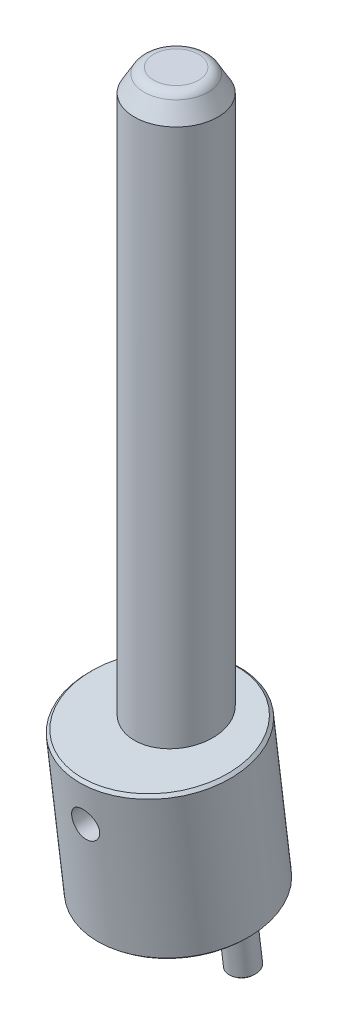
ISO-10303-21;
HEADER;
FILE_DESCRIPTION(('STEP AP214'),'2;1');
FILE_NAME('part.step','',(''),(''),'','','');
FILE_SCHEMA(('AUTOMOTIVE_DESIGN { 1 0 10303 214 1 1 1 1 }'));
ENDSEC;
DATA;
#1=APPLICATION_CONTEXT('core data for automotive mechanical design processes');
#2=APPLICATION_PROTOCOL_DEFINITION('international standard','automotive_design',2000,#1);
#3=PRODUCT_CONTEXT('',#1,'mechanical');
#4=PRODUCT('Part','Part','',(#3));
#5=PRODUCT_RELATED_PRODUCT_CATEGORY('part','',(#4));
#6=PRODUCT_DEFINITION_FORMATION('','',#4);
#7=PRODUCT_DEFINITION_CONTEXT('part definition',#1,'design');
#8=PRODUCT_DEFINITION('design','',#6,#7);
#9=PRODUCT_DEFINITION_SHAPE('','',#8);
#10=(LENGTH_UNIT() NAMED_UNIT(*) SI_UNIT(.MILLI.,.METRE.));
#11=(NAMED_UNIT(*) PLANE_ANGLE_UNIT() SI_UNIT($,.RADIAN.));
#12=(NAMED_UNIT(*) SI_UNIT($,.STERADIAN.) SOLID_ANGLE_UNIT());
#13=UNCERTAINTY_MEASURE_WITH_UNIT(LENGTH_MEASURE(1.E-05),#10,'distance_accuracy_value','');
#14=(GEOMETRIC_REPRESENTATION_CONTEXT(3) GLOBAL_UNCERTAINTY_ASSIGNED_CONTEXT((#13)) GLOBAL_UNIT_ASSIGNED_CONTEXT((#10,
#11,#12)) REPRESENTATION_CONTEXT('',''));
#15=CARTESIAN_POINT('',(0.,0.,0.));
#16=DIRECTION('',(0.,0.,1.));
#17=DIRECTION('',(1.,0.,0.));
#18=AXIS2_PLACEMENT_3D('',#15,#16,#17);
#19=CARTESIAN_POINT('',(0.,-25.2094466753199,-2.57557712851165));
#20=DIRECTION('',(0.,-0.992546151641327,-0.121869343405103));
#21=DIRECTION('',(0.,0.121869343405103,-0.992546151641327));
#22=AXIS2_PLACEMENT_3D('',#19,#20,#21);
#23=PLANE('',#22);
#24=CARTESIAN_POINT('',(-21.5,-25.2094466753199,-2.57557712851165));
#25=DIRECTION('',(0.,-0.992546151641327,-0.121869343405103));
#26=DIRECTION('',(0.,0.121869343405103,-0.992546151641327));
#27=AXIS2_PLACEMENT_3D('',#24,#25,#26);
#28=CIRCLE('',#27,4.50000075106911);
#29=CARTESIAN_POINT('',(-21.5,-24.6610345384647,-7.04203555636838));
#30=VERTEX_POINT('',#29);
#31=EDGE_CURVE('P0_E17',#30,#30,#28,.F.);
#32=ORIENTED_EDGE('',*,*,#31,.F.);
#33=EDGE_LOOP('',(#32));
#34=FACE_BOUND('',#33,.T.);
#35=ADVANCED_FACE('P0_F14',(#34),#23,.T.);
#36=CARTESIAN_POINT('',(0.,-25.2094466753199,-2.57557712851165));
#37=DIRECTION('',(0.,-0.992546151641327,-0.121869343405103));
#38=DIRECTION('',(0.,0.121869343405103,-0.992546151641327));
#39=AXIS2_PLACEMENT_3D('',#36,#37,#38);
#40=PLANE('',#39);
#41=CARTESIAN_POINT('',(21.5,-25.2094466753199,-2.57557712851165));
#42=DIRECTION('',(0.,-0.992546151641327,-0.121869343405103));
#43=DIRECTION('',(0.,0.121869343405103,-0.992546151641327));
#44=AXIS2_PLACEMENT_3D('',#41,#42,#43);
#45=CIRCLE('',#44,4.50000075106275);
#46=CARTESIAN_POINT('',(21.5,-24.6610345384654,-7.04203555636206));
#47=VERTEX_POINT('',#46);
#48=EDGE_CURVE('P0_E121',#47,#47,#45,.F.);
#49=ORIENTED_EDGE('',*,*,#48,.F.);
#50=EDGE_LOOP('',(#49));
#51=FACE_BOUND('',#50,.T.);
#52=ADVANCED_FACE('P0_F111',(#51),#40,.T.);
#53=CARTESIAN_POINT('',(0.,3.12944115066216E-12,-4.77482636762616E-13));
#54=DIRECTION('',(0.,-1.,0.));
#55=DIRECTION('',(0.,0.,-1.));
#56=AXIS2_PLACEMENT_3D('',#53,#54,#55);
#57=PLANE('',#56);
#58=CARTESIAN_POINT('',(0.,2.90045765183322E-12,-2.59850734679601E-12));
#59=DIRECTION('',(0.,-1.,0.));
#60=DIRECTION('',(0.,0.,-1.));
#61=AXIS2_PLACEMENT_3D('',#58,#59,#60);
#62=CIRCLE('',#61,15.);
#63=CARTESIAN_POINT('',(0.,2.90045765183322E-12,-15.0000000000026));
#64=VERTEX_POINT('',#63);
#65=EDGE_CURVE('P0_E36',#64,#64,#62,.F.);
#66=ORIENTED_EDGE('',*,*,#65,.T.);
#67=EDGE_LOOP('',(#66));
#68=FACE_BOUND('',#67,.T.);
#69=ADVANCED_FACE('P0_F108',(#68),#57,.F.);
#70=CARTESIAN_POINT('',(-21.5,-24.7131730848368,-2.51464239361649));
#71=DIRECTION('',(0.,0.992546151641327,0.121869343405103));
#72=DIRECTION('',(0.,-0.121869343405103,0.992546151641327));
#73=AXIS2_PLACEMENT_3D('',#70,#71,#72);
#74=CONICAL_SURFACE('',#73,5.00000135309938,0.785398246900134);
#75=CARTESIAN_POINT('',(-21.5,-24.7131717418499,-2.51464222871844));
#76=DIRECTION('',(0.,-0.992546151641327,-0.121869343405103));
#77=DIRECTION('',(0.,0.121869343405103,-0.992546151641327));
#78=AXIS2_PLACEMENT_3D('',#75,#76,#77);
#79=CIRCLE('',#78,5.);
#80=CARTESIAN_POINT('',(-21.5,-24.1038250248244,-7.47737298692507));
#81=VERTEX_POINT('',#80);
#82=EDGE_CURVE('P0_E33',#81,#81,#79,.F.);
#83=ORIENTED_EDGE('',*,*,#82,.F.);
#84=EDGE_LOOP('',(#83));
#85=FACE_BOUND('',#84,.T.);
#86=ORIENTED_EDGE('',*,*,#31,.T.);
#87=EDGE_LOOP('',(#86));
#88=FACE_BOUND('',#87,.T.);
#89=ADVANCED_FACE('P0_F104',(#85,#88),#74,.T.);
#90=CARTESIAN_POINT('',(21.5,-24.7131730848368,-2.51464239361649));
#91=DIRECTION('',(0.,0.992546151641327,0.121869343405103));
#92=DIRECTION('',(0.,-0.121869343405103,0.992546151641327));
#93=AXIS2_PLACEMENT_3D('',#90,#91,#92);
#94=CONICAL_SURFACE('',#93,5.00000135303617,0.785398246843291);
#95=CARTESIAN_POINT('',(21.5,-24.7131717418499,-2.51464222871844));
#96=DIRECTION('',(0.,-0.992546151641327,-0.121869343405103));
#97=DIRECTION('',(0.,0.121869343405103,-0.992546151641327));
#98=AXIS2_PLACEMENT_3D('',#95,#96,#97);
#99=CIRCLE('',#98,5.);
#100=CARTESIAN_POINT('',(21.5,-24.1038250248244,-7.47737298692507));
#101=VERTEX_POINT('',#100);
#102=EDGE_CURVE('P0_E29',#101,#101,#99,.F.);
#103=ORIENTED_EDGE('',*,*,#102,.F.);
#104=EDGE_LOOP('',(#103));
#105=FACE_BOUND('',#104,.T.);
#106=ORIENTED_EDGE('',*,*,#48,.T.);
#107=EDGE_LOOP('',(#106));
#108=FACE_BOUND('',#107,.T.);
#109=ADVANCED_FACE('P0_F99',(#105,#108),#94,.T.);
#110=CARTESIAN_POINT('',(0.,59.7458556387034,-2.59872418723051E-12));
#111=DIRECTION('',(0.,-1.,0.));
#112=DIRECTION('',(0.,0.,-1.));
#113=AXIS2_PLACEMENT_3D('',#110,#111,#112);
#114=CYLINDRICAL_SURFACE('',#113,15.);
#115=CARTESIAN_POINT('',(0.,45.0000000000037,-2.59959154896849E-12));
#116=DIRECTION('',(0.,0.992546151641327,0.121869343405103));
#117=DIRECTION('',(0.,-0.121869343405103,0.992546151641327));
#118=AXIS2_PLACEMENT_3D('',#115,#116,#117);
#119=ELLIPSE('',#118,15.1126473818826,15.);
#120=CARTESIAN_POINT('',(0.,43.1582315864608,14.9999999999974));
#121=VERTEX_POINT('',#120);
#122=EDGE_CURVE('P0_E32',#121,#121,#119,.F.);
#123=ORIENTED_EDGE('',*,*,#122,.F.);
#124=EDGE_LOOP('',(#123));
#125=FACE_BOUND('',#124,.T.);
#126=ORIENTED_EDGE('',*,*,#65,.F.);
#127=EDGE_LOOP('',(#126));
#128=FACE_BOUND('',#127,.T.);
#129=CARTESIAN_POINT('',(0.,31.0000000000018,14.9999999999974));
#130=CARTESIAN_POINT('',(-0.13627460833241,30.9999999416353,14.9999999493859));
#131=CARTESIAN_POINT('',(-0.27255067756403,30.9944241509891,14.9981386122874));
#132=CARTESIAN_POINT('',(-0.544142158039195,30.9721706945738,14.9907428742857));
#133=CARTESIAN_POINT('',(-0.679457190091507,30.9554888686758,14.9852070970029));
#134=CARTESIAN_POINT('',(-0.948257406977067,30.9111491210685,14.9706027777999));
#135=CARTESIAN_POINT('',(-1.08174007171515,30.8834773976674,14.9615297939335));
#136=CARTESIAN_POINT('',(-1.34580155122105,30.8174009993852,14.9400929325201));
#137=CARTESIAN_POINT('',(-1.47637921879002,30.7789921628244,14.9277277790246));
#138=CARTESIAN_POINT('',(-1.7333461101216,30.6918928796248,14.9000723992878));
#139=CARTESIAN_POINT('',(-1.85974572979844,30.6432305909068,14.8847901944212));
#140=CARTESIAN_POINT('',(-2.10792399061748,30.5359631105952,14.8516789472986));
#141=CARTESIAN_POINT('',(-2.22970089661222,30.4773542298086,14.8338489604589));
#142=CARTESIAN_POINT('',(-2.58680471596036,30.2873070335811,14.7772227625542));
#143=CARTESIAN_POINT('',(-2.81420620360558,30.1415453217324,14.735256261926));
#144=CARTESIAN_POINT('',(-3.24874257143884,29.8108587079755,14.6457020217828));
#145=CARTESIAN_POINT('',(-3.45501840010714,29.6248491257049,14.5979792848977));
#146=CARTESIAN_POINT('',(-3.8341436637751,29.2211801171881,14.5030192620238));
#147=CARTESIAN_POINT('',(-4.0069839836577,29.0035120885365,14.4557821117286));
#148=CARTESIAN_POINT('',(-4.31912807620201,28.5350726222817,14.3656662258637));
#149=CARTESIAN_POINT('',(-4.45732572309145,28.2835298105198,14.322951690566));
#150=CARTESIAN_POINT('',(-4.68909399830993,27.7591186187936,14.2487652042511));
#151=CARTESIAN_POINT('',(-4.78267844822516,27.4862568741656,14.2172897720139));
#152=CARTESIAN_POINT('',(-4.91936749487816,26.9366338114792,14.1705651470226));
#153=CARTESIAN_POINT('',(-4.96406724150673,26.6603139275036,14.1548047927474));
#154=CARTESIAN_POINT('',(-5.00670561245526,26.1036813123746,14.1397828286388));
#155=CARTESIAN_POINT('',(-5.00465868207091,25.8233698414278,14.1405161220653));
#156=CARTESIAN_POINT('',(-4.95509941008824,25.280317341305,14.1579507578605));
#157=CARTESIAN_POINT('',(-4.90966912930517,25.0173587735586,14.1739208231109));
#158=CARTESIAN_POINT('',(-4.77803186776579,24.5030345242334,14.2188326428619));
#159=CARTESIAN_POINT('',(-4.69181981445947,24.2516702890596,14.2477760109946));
#160=CARTESIAN_POINT('',(-4.47968995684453,23.7629279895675,14.3158968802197));
#161=CARTESIAN_POINT('',(-4.3531541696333,23.5258408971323,14.355231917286));
#162=CARTESIAN_POINT('',(-4.06444611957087,23.0756402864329,14.4396288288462));
#163=CARTESIAN_POINT('',(-3.90226546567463,22.8625324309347,14.484692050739));
#164=CARTESIAN_POINT('',(-3.53674216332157,22.4545530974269,14.5783642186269));
#165=CARTESIAN_POINT('',(-3.33169626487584,22.2612084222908,14.6270356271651));
#166=CARTESIAN_POINT('',(-3.00176707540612,21.9988448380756,14.6970107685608));
#167=CARTESIAN_POINT('',(-2.88796886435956,21.9159467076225,14.7198467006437));
#168=CARTESIAN_POINT('',(-2.65358317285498,21.7599196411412,14.763897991));
#169=CARTESIAN_POINT('',(-2.53299841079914,21.6867868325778,14.7851139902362));
#170=CARTESIAN_POINT('',(-2.28442944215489,21.5500863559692,14.8255663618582));
#171=CARTESIAN_POINT('',(-2.15637801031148,21.4866337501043,14.8447781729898));
#172=CARTESIAN_POINT('',(-1.89503347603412,21.3708247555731,14.880397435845));
#173=CARTESIAN_POINT('',(-1.76174256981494,21.3184637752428,14.8968060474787));
#174=CARTESIAN_POINT('',(-1.49104566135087,21.2253547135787,14.9263287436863));
#175=CARTESIAN_POINT('',(-1.3536464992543,21.1845884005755,14.9394479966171));
#176=CARTESIAN_POINT('',(-1.0756272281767,21.1149668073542,14.9620340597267));
#177=CARTESIAN_POINT('',(-0.93500858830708,21.0861062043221,14.9715025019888));
#178=CARTESIAN_POINT('',(-0.662330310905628,21.0422867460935,14.9859443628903));
#179=CARTESIAN_POINT('',(-0.530427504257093,21.0264417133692,14.9912035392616));
#180=CARTESIAN_POINT('',(-0.265683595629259,21.0052983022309,14.9982313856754));
#181=CARTESIAN_POINT('',(-0.132842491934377,20.9999999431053,15.0000000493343));
#182=CARTESIAN_POINT('',(0.136274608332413,21.0000000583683,14.9999999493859));
#183=CARTESIAN_POINT('',(0.272550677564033,21.0055758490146,14.9981386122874));
#184=CARTESIAN_POINT('',(0.544142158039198,21.0278293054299,14.9907428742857));
#185=CARTESIAN_POINT('',(0.67945719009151,21.0445111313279,14.9852070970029));
#186=CARTESIAN_POINT('',(0.94825740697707,21.0888508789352,14.9706027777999));
#187=CARTESIAN_POINT('',(1.08174007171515,21.1165226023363,14.9615297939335));
#188=CARTESIAN_POINT('',(1.34580155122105,21.1825990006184,14.9400929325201));
#189=CARTESIAN_POINT('',(1.47637921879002,21.2210078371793,14.9277277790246));
#190=CARTESIAN_POINT('',(1.7333461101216,21.3081071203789,14.9000723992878));
#191=CARTESIAN_POINT('',(1.85974572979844,21.3567694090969,14.8847901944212));
#192=CARTESIAN_POINT('',(2.10792399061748,21.4640368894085,14.8516789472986));
#193=CARTESIAN_POINT('',(2.22970089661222,21.5226457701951,14.8338489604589));
#194=CARTESIAN_POINT('',(2.58680471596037,21.7126929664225,14.7772227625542));
#195=CARTESIAN_POINT('',(2.81420620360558,21.8584546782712,14.735256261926));
#196=CARTESIAN_POINT('',(3.24874257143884,22.1891412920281,14.6457020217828));
#197=CARTESIAN_POINT('',(3.45501840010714,22.3751508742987,14.5979792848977));
#198=CARTESIAN_POINT('',(3.8341436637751,22.7788198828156,14.5030192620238));
#199=CARTESIAN_POINT('',(4.0069839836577,22.9964879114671,14.4557821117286));
#200=CARTESIAN_POINT('',(4.31912807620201,23.464927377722,14.3656662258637));
#201=CARTESIAN_POINT('',(4.45732572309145,23.7164701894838,14.322951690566));
#202=CARTESIAN_POINT('',(4.68909399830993,24.24088138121,14.2487652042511));
#203=CARTESIAN_POINT('',(4.78267844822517,24.5137431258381,14.2172897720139));
#204=CARTESIAN_POINT('',(4.91936749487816,25.0633661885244,14.1705651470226));
#205=CARTESIAN_POINT('',(4.96406724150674,25.3396860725,14.1548047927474));
#206=CARTESIAN_POINT('',(5.00670561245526,25.896318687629,14.1397828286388));
#207=CARTESIAN_POINT('',(5.00465868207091,26.1766301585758,14.1405161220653));
#208=CARTESIAN_POINT('',(4.95509941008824,26.7196826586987,14.1579507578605));
#209=CARTESIAN_POINT('',(4.90966912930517,26.982641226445,14.1739208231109));
#210=CARTESIAN_POINT('',(4.77803186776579,27.4969654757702,14.2188326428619));
#211=CARTESIAN_POINT('',(4.69181981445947,27.748329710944,14.2477760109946));
#212=CARTESIAN_POINT('',(4.47968995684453,28.2370720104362,14.3158968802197));
#213=CARTESIAN_POINT('',(4.35315416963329,28.4741591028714,14.355231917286));
#214=CARTESIAN_POINT('',(4.06444611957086,28.9243597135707,14.4396288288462));
#215=CARTESIAN_POINT('',(3.90226546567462,29.1374675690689,14.484692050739));
#216=CARTESIAN_POINT('',(3.53674216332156,29.5454469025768,14.5783642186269));
#217=CARTESIAN_POINT('',(3.33169626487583,29.7387915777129,14.6270356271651));
#218=CARTESIAN_POINT('',(3.00176707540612,30.0011551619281,14.6970107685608));
#219=CARTESIAN_POINT('',(2.88796886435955,30.0840532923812,14.7198467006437));
#220=CARTESIAN_POINT('',(2.65358317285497,30.2400803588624,14.763897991));
#221=CARTESIAN_POINT('',(2.53299841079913,30.3132131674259,14.7851139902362));
#222=CARTESIAN_POINT('',(2.28442944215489,30.4499136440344,14.8255663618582));
#223=CARTESIAN_POINT('',(2.15637801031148,30.5133662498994,14.8447781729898));
#224=CARTESIAN_POINT('',(1.89503347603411,30.6291752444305,14.880397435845));
#225=CARTESIAN_POINT('',(1.76174256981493,30.6815362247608,14.8968060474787));
#226=CARTESIAN_POINT('',(1.49104566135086,30.7746452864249,14.9263287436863));
#227=CARTESIAN_POINT('',(1.3536464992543,30.8154115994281,14.9394479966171));
#228=CARTESIAN_POINT('',(1.0756272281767,30.8850331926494,14.9620340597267));
#229=CARTESIAN_POINT('',(0.935008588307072,30.9138937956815,14.9715025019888));
#230=CARTESIAN_POINT('',(0.662330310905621,30.9577132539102,14.9859443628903));
#231=CARTESIAN_POINT('',(0.530427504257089,30.9735582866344,14.9912035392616));
#232=CARTESIAN_POINT('',(0.265683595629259,30.9947016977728,14.9982313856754));
#233=CARTESIAN_POINT('',(0.132842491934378,31.0000000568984,15.0000000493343));
#234=CARTESIAN_POINT('',(0.,31.0000000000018,14.9999999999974));
#235=B_SPLINE_CURVE_WITH_KNOTS('',3,(#129,#130,#131,#132,#133,#134,#135,#136,#137,#138,#139,
#140,#141,#142,#143,#144,#145,#146,#147,#148,#149,#150,#151,#152,#153,#154,#155,#156,#157,#158,
#159,#160,#161,#162,#163,#164,#165,#166,#167,#168,#169,#170,#171,#172,#173,#174,#175,#176,#177,
#178,#179,#180,#181,#182,#183,#184,#185,#186,#187,#188,#189,#190,#191,#192,#193,#194,#195,#196,
#197,#198,#199,#200,#201,#202,#203,#204,#205,#206,#207,#208,#209,#210,#211,#212,#213,#214,#215,
#216,#217,#218,#219,#220,#221,#222,#223,#224,#225,#226,#227,#228,#229,#230,#231,#232,#233,#234),
.UNSPECIFIED.,.T.,.F.,(4,2,2,2,2,2,2,2,2,2,2,2,2,2,2,2,2,2,2,2,2,2,2,2,2,2,2,2,2,2,2,2,2,2,2,2,
2,2,2,2,2,2,2,2,2,2,2,2,2,2,2,2,4),(0.,0.408700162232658,0.817553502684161,1.22692193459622,
1.6364492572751,2.04486626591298,2.45343508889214,3.26962321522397,4.11140352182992,
4.9534129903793,5.81961254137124,6.68554356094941,7.52228757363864,8.35877302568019,
9.15703078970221,9.95538786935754,10.7666215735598,11.5780464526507,12.4317109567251,
12.8591940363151,13.286507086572,13.7185586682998,14.150431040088,14.5816205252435,
15.0126170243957,15.4110232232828,15.8094301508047,16.2181303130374,16.6269836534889,
17.0363520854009,17.4458794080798,17.8542964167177,18.2628652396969,19.0790533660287,
19.9208336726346,20.762843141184,21.629042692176,22.4949737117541,23.3317177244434,
24.1682031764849,24.9664609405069,25.7648180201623,26.5760517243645,27.3874766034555,
28.2411411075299,28.6686241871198,29.0959372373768,29.5279888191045,29.9598611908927,
30.3910506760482,30.8220471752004,31.2204533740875,31.6188603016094),.UNSPECIFIED.);
#236=CARTESIAN_POINT('',(0.,31.0000000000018,14.9999999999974));
#237=VERTEX_POINT('',#236);
#238=EDGE_CURVE('P0_E84',#237,#237,#235,.T.);
#239=ORIENTED_EDGE('',*,*,#238,.T.);
#240=EDGE_LOOP('',(#239));
#241=FACE_BOUND('',#240,.T.);
#242=ADVANCED_FACE('P0_F93',(#125,#128,#241),#114,.F.);
#243=CARTESIAN_POINT('',(-21.5,-10.3212544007,-0.7475369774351));
#244=DIRECTION('',(0.,-0.992546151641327,-0.121869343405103));
#245=DIRECTION('',(0.,0.121869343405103,-0.992546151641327));
#246=AXIS2_PLACEMENT_3D('',#243,#244,#245);
#247=CYLINDRICAL_SURFACE('',#246,5.);
#248=CARTESIAN_POINT('',(-21.5,-10.3212544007,-0.7475369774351));
#249=DIRECTION('',(0.,-0.992546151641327,-0.121869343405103));
#250=DIRECTION('',(0.,0.121869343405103,-0.992546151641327));
#251=AXIS2_PLACEMENT_3D('',#248,#249,#250);
#252=CIRCLE('',#251,5.);
#253=CARTESIAN_POINT('',(-21.5,-9.71190768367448,-5.71026773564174));
#254=VERTEX_POINT('',#253);
#255=EDGE_CURVE('P0_E80',#254,#254,#252,.T.);
#256=ORIENTED_EDGE('',*,*,#255,.T.);
#257=EDGE_LOOP('',(#256));
#258=FACE_BOUND('',#257,.T.);
#259=ORIENTED_EDGE('',*,*,#82,.T.);
#260=EDGE_LOOP('',(#259));
#261=FACE_BOUND('',#260,.T.);
#262=ADVANCED_FACE('P0_F98',(#258,#261),#247,.T.);
#263=CARTESIAN_POINT('',(21.5,-10.3212544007,-0.7475369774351));
#264=DIRECTION('',(0.,-0.992546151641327,-0.121869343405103));
#265=DIRECTION('',(0.,0.121869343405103,-0.992546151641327));
#266=AXIS2_PLACEMENT_3D('',#263,#264,#265);
#267=CYLINDRICAL_SURFACE('',#266,5.);
#268=CARTESIAN_POINT('',(21.5,-10.3212544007,-0.7475369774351));
#269=DIRECTION('',(0.,-0.992546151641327,-0.121869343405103));
#270=DIRECTION('',(0.,0.121869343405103,-0.992546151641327));
#271=AXIS2_PLACEMENT_3D('',#268,#269,#270);
#272=CIRCLE('',#271,5.);
#273=CARTESIAN_POINT('',(21.5,-9.71190768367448,-5.71026773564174));
#274=VERTEX_POINT('',#273);
#275=EDGE_CURVE('P0_E76',#274,#274,#272,.T.);
#276=ORIENTED_EDGE('',*,*,#275,.T.);
#277=EDGE_LOOP('',(#276));
#278=FACE_BOUND('',#277,.T.);
#279=ORIENTED_EDGE('',*,*,#102,.T.);
#280=EDGE_LOOP('',(#279));
#281=FACE_BOUND('',#280,.T.);
#282=ADVANCED_FACE('P0_F178',(#278,#281),#267,.T.);
#283=CARTESIAN_POINT('',(0.,44.268783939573,5.95527690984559));
#284=DIRECTION('',(0.,0.992546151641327,0.121869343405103));
#285=DIRECTION('',(0.,-0.121869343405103,0.992546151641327));
#286=AXIS2_PLACEMENT_3D('',#283,#284,#285);
#287=PLANE('',#286);
#288=ORIENTED_EDGE('',*,*,#122,.T.);
#289=EDGE_LOOP('',(#288));
#290=FACE_BOUND('',#289,.T.);
#291=CARTESIAN_POINT('',(0.,44.268783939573,5.95527690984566));
#292=DIRECTION('',(0.,0.992546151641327,0.121869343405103));
#293=DIRECTION('',(0.,-0.121869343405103,0.992546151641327));
#294=AXIS2_PLACEMENT_3D('',#291,#292,#293);
#295=CIRCLE('',#294,27.9999945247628);
#296=CARTESIAN_POINT('',(0.,40.8564429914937,33.7465637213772));
#297=VERTEX_POINT('',#296);
#298=EDGE_CURVE('P0_E46',#297,#297,#295,.F.);
#299=ORIENTED_EDGE('',*,*,#298,.F.);
#300=EDGE_LOOP('',(#299));
#301=FACE_BOUND('',#300,.T.);
#302=ADVANCED_FACE('P0_F71',(#290,#301),#287,.T.);
#303=CARTESIAN_POINT('',(0.,26.0000000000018,-4.49837953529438));
#304=DIRECTION('',(0.,0.,1.));
#305=DIRECTION('',(0.,-1.,0.));
#306=AXIS2_PLACEMENT_3D('',#303,#304,#305);
#307=CYLINDRICAL_SURFACE('',#306,5.);
#308=ORIENTED_EDGE('',*,*,#238,.F.);
#309=EDGE_LOOP('',(#308));
#310=FACE_BOUND('',#309,.T.);
#311=CARTESIAN_POINT('',(0.,21.0000000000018,32.3160144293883));
#312=CARTESIAN_POINT('',(-0.1403461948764,21.0000006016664,32.3160142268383));
#313=CARTESIAN_POINT('',(-0.280708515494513,21.0059135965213,32.315711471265));
#314=CARTESIAN_POINT('',(-0.560489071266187,21.0295298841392,32.3145230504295));
#315=CARTESIAN_POINT('',(-0.699906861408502,21.0472383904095,32.3136371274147));
#316=CARTESIAN_POINT('',(-0.976970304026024,21.094359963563,32.3113500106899));
#317=CARTESIAN_POINT('',(-1.11461288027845,21.1237911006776,32.3099480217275));
#318=CARTESIAN_POINT('',(-1.38697401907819,21.1941604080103,32.3067422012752));
#319=CARTESIAN_POINT('',(-1.52169146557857,21.2351028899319,32.3049382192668));
#320=CARTESIAN_POINT('',(-1.78703419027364,21.3281426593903,32.3010858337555));
#321=CARTESIAN_POINT('',(-1.91766413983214,21.3802266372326,32.2990377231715));
#322=CARTESIAN_POINT('',(-2.17412119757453,21.4952299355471,32.2948846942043));
#323=CARTESIAN_POINT('',(-2.29994651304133,21.5581532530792,32.2927797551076));
#324=CARTESIAN_POINT('',(-2.54575621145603,21.6943233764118,32.2887356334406));
#325=CARTESIAN_POINT('',(-2.66574505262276,21.7675621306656,32.2867963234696));
#326=CARTESIAN_POINT('',(-2.89917970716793,21.9239113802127,32.2833237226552));
#327=CARTESIAN_POINT('',(-3.01262309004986,22.0070255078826,32.2817905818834));
#328=CARTESIAN_POINT('',(-3.232146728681,22.1825423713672,32.2793890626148));
#329=CARTESIAN_POINT('',(-3.33822469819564,22.2749479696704,32.2785208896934));
#330=CARTESIAN_POINT('',(-3.5422598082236,22.4684045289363,32.2777149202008));
#331=CARTESIAN_POINT('',(-3.64021392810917,22.5694586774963,32.2777774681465));
#332=CARTESIAN_POINT('',(-3.82722424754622,22.7794235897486,32.2790961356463));
#333=CARTESIAN_POINT('',(-3.91628336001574,22.8883317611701,32.2803518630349));
#334=CARTESIAN_POINT('',(-4.08493121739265,23.1132880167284,32.2843069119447));
#335=CARTESIAN_POINT('',(-4.16451648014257,23.2293387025,32.2870067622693));
#336=CARTESIAN_POINT('',(-4.31322552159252,23.4670878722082,32.294060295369));
#337=CARTESIAN_POINT('',(-4.38240064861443,23.5887544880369,32.2984054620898));
#338=CARTESIAN_POINT('',(-4.51030821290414,23.8374364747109,32.3089450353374));
#339=CARTESIAN_POINT('',(-4.56903679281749,23.9644537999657,32.3151401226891));
#340=CARTESIAN_POINT('',(-4.67558894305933,24.2228181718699,32.3295311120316));
#341=CARTESIAN_POINT('',(-4.72341729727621,24.354163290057,32.3377261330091));
#342=CARTESIAN_POINT('',(-4.80789683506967,24.6202704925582,32.3562192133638));
#343=CARTESIAN_POINT('',(-4.84454391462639,24.7550338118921,32.3665180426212));
#344=CARTESIAN_POINT('',(-4.93688227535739,25.1611177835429,32.4005185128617));
#345=CARTESIAN_POINT('',(-4.9757781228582,25.4362013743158,32.4274299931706));
#346=CARTESIAN_POINT('',(-5.00762672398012,25.9879273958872,32.4895650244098));
#347=CARTESIAN_POINT('',(-5.00057783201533,26.2645698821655,32.5247888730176));
#348=CARTESIAN_POINT('',(-4.94109053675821,26.81396350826,32.6026732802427));
#349=CARTESIAN_POINT('',(-4.88831502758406,27.086670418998,32.6453871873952));
#350=CARTESIAN_POINT('',(-4.7387120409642,27.6189440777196,32.7361104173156));
#351=CARTESIAN_POINT('',(-4.64187793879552,27.8785088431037,32.7841205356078));
#352=CARTESIAN_POINT('',(-4.46456377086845,28.2555797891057,32.8586334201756));
#353=CARTESIAN_POINT('',(-4.39916939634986,28.3805882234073,32.8841965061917));
#354=CARTESIAN_POINT('',(-4.25809696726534,28.6245830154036,32.935611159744));
#355=CARTESIAN_POINT('',(-4.18242246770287,28.7435714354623,32.9614626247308));
#356=CARTESIAN_POINT('',(-4.02125558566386,28.9747907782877,33.0130529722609));
#357=CARTESIAN_POINT('',(-3.93575922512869,29.0870189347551,33.0387918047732));
#358=CARTESIAN_POINT('',(-3.75555564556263,29.3038867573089,33.0897102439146));
#359=CARTESIAN_POINT('',(-3.66085184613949,29.4085292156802,33.114890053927));
#360=CARTESIAN_POINT('',(-3.46147534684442,29.6109051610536,33.1645984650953));
#361=CARTESIAN_POINT('',(-3.35668562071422,29.708526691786,33.1891137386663));
#362=CARTESIAN_POINT('',(-3.13896542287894,29.8945330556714,33.2366741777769));
#363=CARTESIAN_POINT('',(-3.02603811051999,29.98292144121,33.2597199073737));
#364=CARTESIAN_POINT('',(-2.79266578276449,30.149893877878,33.303929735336));
#365=CARTESIAN_POINT('',(-2.67221491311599,30.2284701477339,33.3250923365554));
#366=CARTESIAN_POINT('',(-2.42475245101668,30.3750711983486,33.3650874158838));
#367=CARTESIAN_POINT('',(-2.29774365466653,30.4431004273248,33.3839208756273));
#368=CARTESIAN_POINT('',(-2.04039417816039,30.5669254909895,33.4185615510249));
#369=CARTESIAN_POINT('',(-1.91015664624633,30.6229219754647,33.4344177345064));
#370=CARTESIAN_POINT('',(-1.6451638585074,30.7237189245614,33.4631901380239));
#371=CARTESIAN_POINT('',(-1.51041056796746,30.7685241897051,33.4761076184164));
#372=CARTESIAN_POINT('',(-1.23759367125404,30.8464886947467,33.4987168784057));
#373=CARTESIAN_POINT('',(-1.09953687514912,30.8796700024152,33.5084147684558));
#374=CARTESIAN_POINT('',(-0.820969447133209,30.9341801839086,33.5244053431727));
#375=CARTESIAN_POINT('',(-0.680460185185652,30.9555154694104,33.5306998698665));
#376=CARTESIAN_POINT('',(-0.449764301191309,30.9805445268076,33.5380965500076));
#377=CARTESIAN_POINT('',(-0.359985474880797,30.9878372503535,33.5402559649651));
#378=CARTESIAN_POINT('',(-0.180141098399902,30.9975652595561,33.5431378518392));
#379=CARTESIAN_POINT('',(-0.0900755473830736,31.0000005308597,33.5438603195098));
#380=CARTESIAN_POINT('',(0.13670924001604,30.9999991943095,33.5438596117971));
#381=CARTESIAN_POINT('',(0.273441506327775,30.9943875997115,33.5421943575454));
#382=CARTESIAN_POINT('',(0.545961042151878,30.9719848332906,33.5355649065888));
#383=CARTESIAN_POINT('',(0.681747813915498,30.9551881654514,33.5305990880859));
#384=CARTESIAN_POINT('',(0.951565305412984,30.9105245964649,33.5174577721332));
#385=CARTESIAN_POINT('',(1.0855927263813,30.8826393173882,33.5092769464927));
#386=CARTESIAN_POINT('',(1.35075378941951,30.8160315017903,33.4898669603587));
#387=CARTESIAN_POINT('',(1.48188628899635,30.7773047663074,33.4786366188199));
#388=CARTESIAN_POINT('',(1.73998721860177,30.6894545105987,33.453381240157));
#389=CARTESIAN_POINT('',(1.86696488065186,30.6403561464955,33.4393629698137));
#390=CARTESIAN_POINT('',(2.11628565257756,30.5320871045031,33.408777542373));
#391=CARTESIAN_POINT('',(2.23862702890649,30.4729127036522,33.3922094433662));
#392=CARTESIAN_POINT('',(2.47775385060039,30.3450094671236,33.3568484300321));
#393=CARTESIAN_POINT('',(2.59454327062,30.2762876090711,33.3380571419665));
#394=CARTESIAN_POINT('',(2.82197975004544,30.1297387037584,33.2985701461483));
#395=CARTESIAN_POINT('',(2.93262446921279,30.0519082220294,33.2778737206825));
#396=CARTESIAN_POINT('',(3.149501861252,29.8858337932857,33.2344511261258));
#397=CARTESIAN_POINT('',(3.25557746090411,29.7973936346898,33.2116895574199));
#398=CARTESIAN_POINT('',(3.4599293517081,29.6121926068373,33.1649502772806));
#399=CARTESIAN_POINT('',(3.55820275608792,29.5154286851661,33.1409721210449));
#400=CARTESIAN_POINT('',(3.84035615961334,29.2136228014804,33.0678255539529));
#401=CARTESIAN_POINT('',(4.01174082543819,28.996935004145,33.017409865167));
#402=CARTESIAN_POINT('',(4.32137776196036,28.5311042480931,32.9149540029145));
#403=CARTESIAN_POINT('',(4.45839561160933,28.2811451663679,32.8629134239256));
#404=CARTESIAN_POINT('',(4.68824676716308,27.7609994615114,32.762066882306));
#405=CARTESIAN_POINT('',(4.78107919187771,27.4908124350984,32.7132609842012));
#406=CARTESIAN_POINT('',(4.91969612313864,26.9371411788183,32.6215885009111));
#407=CARTESIAN_POINT('',(4.96539505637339,26.6536337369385,32.5787328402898));
#408=CARTESIAN_POINT('',(5.00753076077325,26.0817237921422,32.5011046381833));
#409=CARTESIAN_POINT('',(5.0039747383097,25.793322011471,32.4663309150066));
#410=CARTESIAN_POINT('',(4.961795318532,25.3671635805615,32.4213989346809));
#411=CARTESIAN_POINT('',(4.94200263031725,25.2276707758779,32.4077374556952));
#412=CARTESIAN_POINT('',(4.8906765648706,24.9506761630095,32.382623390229));
#413=CARTESIAN_POINT('',(4.85914786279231,24.8131735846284,32.3711699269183));
#414=CARTESIAN_POINT('',(4.78452071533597,24.5411400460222,32.3504459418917));
#415=CARTESIAN_POINT('',(4.74141861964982,24.406610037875,32.3411761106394));
#416=CARTESIAN_POINT('',(4.64395547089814,24.1416145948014,32.324740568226));
#417=CARTESIAN_POINT('',(4.58959871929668,24.0111476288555,32.317574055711));
#418=CARTESIAN_POINT('',(4.47093290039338,23.757213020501,32.3053015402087));
#419=CARTESIAN_POINT('',(4.40679287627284,23.6336677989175,32.3001650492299));
#420=CARTESIAN_POINT('',(4.26843362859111,23.3923554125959,32.2916228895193));
#421=CARTESIAN_POINT('',(4.19421821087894,23.2745860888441,32.2882165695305));
#422=CARTESIAN_POINT('',(4.03618732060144,23.0455877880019,32.2829236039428));
#423=CARTESIAN_POINT('',(3.95236899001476,22.934360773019,32.2810374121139));
#424=CARTESIAN_POINT('',(3.77577258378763,22.7193152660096,32.2785533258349));
#425=CARTESIAN_POINT('',(3.68299773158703,22.6154941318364,32.2779549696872));
#426=CARTESIAN_POINT('',(3.48889112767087,22.4157175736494,32.2777953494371));
#427=CARTESIAN_POINT('',(3.38754011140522,22.3197808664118,32.2782364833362));
#428=CARTESIAN_POINT('',(3.17721816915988,22.1367485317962,32.279901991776));
#429=CARTESIAN_POINT('',(3.06825001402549,22.0496497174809,32.2811260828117));
#430=CARTESIAN_POINT('',(2.84333243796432,21.8847943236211,32.2841021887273));
#431=CARTESIAN_POINT('',(2.7273773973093,21.8070454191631,32.2858546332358));
#432=CARTESIAN_POINT('',(2.48942071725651,21.6615410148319,32.289640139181));
#433=CARTESIAN_POINT('',(2.36742127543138,21.5937819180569,32.2916730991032));
#434=CARTESIAN_POINT('',(2.11717785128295,21.4681885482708,32.295809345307));
#435=CARTESIAN_POINT('',(1.98889130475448,21.4104390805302,32.2979130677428));
#436=CARTESIAN_POINT('',(1.72795524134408,21.3059704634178,32.3019676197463));
#437=CARTESIAN_POINT('',(1.59530735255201,21.2592472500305,32.3039185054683));
#438=CARTESIAN_POINT('',(1.3267530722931,21.1771988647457,32.307492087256));
#439=CARTESIAN_POINT('',(1.19085200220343,21.1418562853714,32.3091152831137));
#440=CARTESIAN_POINT('',(0.91660692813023,21.0827349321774,32.3119018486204));
#441=CARTESIAN_POINT('',(0.778264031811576,21.0589510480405,32.3130654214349));
#442=CARTESIAN_POINT('',(0.533230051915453,21.0273666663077,32.3146304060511));
#443=CARTESIAN_POINT('',(0.426849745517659,21.0171083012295,32.3151473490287));
#444=CARTESIAN_POINT('',(0.213649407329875,21.0034247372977,32.3158394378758));
#445=CARTESIAN_POINT('',(0.106829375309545,20.999999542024,32.3160145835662));
#446=CARTESIAN_POINT('',(0.,21.0000000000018,32.3160144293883));
#447=B_SPLINE_CURVE_WITH_KNOTS('',3,(#311,#312,#313,#314,#315,#316,#317,#318,#319,#320,#321,
#322,#323,#324,#325,#326,#327,#328,#329,#330,#331,#332,#333,#334,#335,#336,#337,#338,#339,#340,
#341,#342,#343,#344,#345,#346,#347,#348,#349,#350,#351,#352,#353,#354,#355,#356,#357,#358,#359,
#360,#361,#362,#363,#364,#365,#366,#367,#368,#369,#370,#371,#372,#373,#374,#375,#376,#377,#378,
#379,#380,#381,#382,#383,#384,#385,#386,#387,#388,#389,#390,#391,#392,#393,#394,#395,#396,#397,
#398,#399,#400,#401,#402,#403,#404,#405,#406,#407,#408,#409,#410,#411,#412,#413,#414,#415,#416,
#417,#418,#419,#420,#421,#422,#423,#424,#425,#426,#427,#428,#429,#430,#431,#432,#433,#434,#435,
#436,#437,#438,#439,#440,#441,#442,#443,#444,#445,#446),.UNSPECIFIED.,.T.,.F.,(4,2,2,2,2,2,2,2,
2,2,2,2,2,2,2,2,2,2,2,2,2,2,2,2,2,2,2,2,2,2,2,2,2,2,2,2,2,2,2,2,2,2,2,2,2,2,2,2,2,2,2,2,2,2,2,2,
2,2,2,2,2,2,2,2,2,2,2,4),(0.,0.42094192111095,0.84207001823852,1.26384980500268,
1.68578778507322,2.10722450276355,2.5288169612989,2.95008215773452,3.37150278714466,
3.79305364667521,4.21476055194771,4.63632890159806,5.05805172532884,5.47762093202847,
5.89734474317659,6.31688398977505,6.73657704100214,7.56965242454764,8.40275764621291,
9.24205745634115,10.0814835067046,10.5112052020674,10.9407786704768,11.3705267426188,
11.8001158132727,12.2354872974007,12.6706906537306,13.1062369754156,13.5415991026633,
13.9690137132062,14.3962446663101,14.8226600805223,15.2488444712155,15.5190143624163,
15.7891850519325,16.199227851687,16.6094722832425,17.0203994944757,17.431486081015,
17.8415868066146,18.2518393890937,18.6617937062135,19.0719031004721,19.4913178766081,
19.9108871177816,20.7493761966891,21.6146719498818,22.4799849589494,23.3468662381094,
24.2136206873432,24.6378504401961,25.0619113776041,25.4861062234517,25.9101392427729,
26.327537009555,26.7447775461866,27.1621425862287,27.5793579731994,27.9975367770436,
28.4155642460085,28.833932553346,29.252149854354,29.6737535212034,30.0952015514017,
30.5160018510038,30.9366159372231,31.2570303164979,31.5774448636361),.UNSPECIFIED.);
#448=CARTESIAN_POINT('',(0.,21.0000000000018,32.3160144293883));
#449=VERTEX_POINT('',#448);
#450=EDGE_CURVE('P0_E39',#449,#449,#447,.T.);
#451=ORIENTED_EDGE('',*,*,#450,.F.);
#452=EDGE_LOOP('',(#451));
#453=FACE_BOUND('',#452,.T.);
#454=ADVANCED_FACE('P0_F48',(#310,#453),#307,.F.);
#455=CARTESIAN_POINT('',(0.,-10.3212544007,-0.7475369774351));
#456=DIRECTION('',(0.,0.992546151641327,0.121869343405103));
#457=DIRECTION('',(0.,-0.121869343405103,0.992546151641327));
#458=AXIS2_PLACEMENT_3D('',#455,#456,#457);
#459=PLANE('',#458);
#460=ORIENTED_EDGE('',*,*,#275,.F.);
#461=EDGE_LOOP('',(#460));
#462=FACE_BOUND('',#461,.T.);
#463=ORIENTED_EDGE('',*,*,#255,.F.);
#464=EDGE_LOOP('',(#463));
#465=FACE_BOUND('',#464,.T.);
#466=CARTESIAN_POINT('',(-1.28369537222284E-13,-10.3212544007,-0.74753697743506));
#467=DIRECTION('',(0.,0.992546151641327,0.121869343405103));
#468=DIRECTION('',(0.,-0.121869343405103,0.992546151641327));
#469=AXIS2_PLACEMENT_3D('',#466,#467,#468);
#470=CIRCLE('',#469,27.9999942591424);
#471=CARTESIAN_POINT('',(-1.28369537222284E-13,-13.7335953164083,27.0437495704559));
#472=VERTEX_POINT('',#471);
#473=EDGE_CURVE('P0_E26',#472,#472,#470,.T.);
#474=ORIENTED_EDGE('',*,*,#473,.F.);
#475=EDGE_LOOP('',(#474));
#476=FACE_BOUND('',#475,.T.);
#477=ADVANCED_FACE('P0_F63',(#462,#465,#476),#459,.F.);
#478=CARTESIAN_POINT('',(0.,43.2762348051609,5.83340720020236));
#479=DIRECTION('',(0.,-0.992546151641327,-0.121869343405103));
#480=DIRECTION('',(0.,0.121869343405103,-0.992546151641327));
#481=AXIS2_PLACEMENT_3D('',#478,#479,#480);
#482=CONICAL_SURFACE('',#481,28.9999973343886,0.785398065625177);
#483=ORIENTED_EDGE('',*,*,#298,.T.);
#484=EDGE_LOOP('',(#483));
#485=FACE_BOUND('',#484,.T.);
#486=CARTESIAN_POINT('',(0.,43.2762374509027,5.83340752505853));
#487=DIRECTION('',(0.,0.992546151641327,0.121869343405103));
#488=DIRECTION('',(0.,-0.121869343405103,0.992546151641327));
#489=AXIS2_PLACEMENT_3D('',#486,#487,#488);
#490=CIRCLE('',#489,29.);
#491=CARTESIAN_POINT('',(0.,39.7420264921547,34.617245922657));
#492=VERTEX_POINT('',#491);
#493=EDGE_CURVE('P0_E21',#492,#492,#490,.F.);
#494=ORIENTED_EDGE('',*,*,#493,.F.);
#495=EDGE_LOOP('',(#494));
#496=FACE_BOUND('',#495,.T.);
#497=ADVANCED_FACE('P0_F60',(#485,#496),#482,.T.);
#498=CARTESIAN_POINT('',(-1.28369537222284E-13,-9.32870509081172,-0.625667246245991));
#499=DIRECTION('',(0.,0.992546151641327,0.121869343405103));
#500=DIRECTION('',(0.,-0.121869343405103,0.992546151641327));
#501=AXIS2_PLACEMENT_3D('',#498,#499,#500);
#502=CONICAL_SURFACE('',#501,28.9999972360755,0.785398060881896);
#503=CARTESIAN_POINT('',(0.,-9.32870783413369,-0.625667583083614));
#504=DIRECTION('',(0.,0.992546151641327,0.121869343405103));
#505=DIRECTION('',(0.,-0.121869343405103,0.992546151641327));
#506=AXIS2_PLACEMENT_3D('',#503,#504,#505);
#507=CIRCLE('',#506,29.);
#508=CARTESIAN_POINT('',(0.,-12.8629187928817,28.1581708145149));
#509=VERTEX_POINT('',#508);
#510=EDGE_CURVE('P0_E9',#509,#509,#507,.T.);
#511=ORIENTED_EDGE('',*,*,#510,.F.);
#512=EDGE_LOOP('',(#511));
#513=FACE_BOUND('',#512,.T.);
#514=ORIENTED_EDGE('',*,*,#473,.T.);
#515=EDGE_LOOP('',(#514));
#516=FACE_BOUND('',#515,.T.);
#517=ADVANCED_FACE('P0_F56',(#513,#516),#502,.T.);
#518=CARTESIAN_POINT('',(0.,-13.0507563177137,-1.08267767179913));
#519=DIRECTION('',(0.,0.992546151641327,0.121869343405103));
#520=DIRECTION('',(0.,-0.121869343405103,0.992546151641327));
#521=AXIS2_PLACEMENT_3D('',#518,#519,#520);
#522=CYLINDRICAL_SURFACE('',#521,29.);
#523=ORIENTED_EDGE('',*,*,#493,.T.);
#524=EDGE_LOOP('',(#523));
#525=FACE_BOUND('',#524,.T.);
#526=ORIENTED_EDGE('',*,*,#510,.T.);
#527=EDGE_LOOP('',(#526));
#528=FACE_BOUND('',#527,.T.);
#529=ORIENTED_EDGE('',*,*,#450,.T.);
#530=EDGE_LOOP('',(#529));
#531=FACE_BOUND('',#530,.T.);
#532=ADVANCED_FACE('P0_F52',(#525,#528,#531),#522,.T.);
#533=CLOSED_SHELL('',(#35,#52,#69,#89,#109,#242,#262,#282,#302,#454,#477,#497,#517,#532));
#534=MANIFOLD_SOLID_BREP('P0_B1',#533);
#535=CARTESIAN_POINT('',(0.,245.,0.));
#536=DIRECTION('',(0.,1.,0.));
#537=DIRECTION('',(-1.,0.,0.));
#538=AXIS2_PLACEMENT_3D('',#535,#536,#537);
#539=PLANE('',#538);
#540=CARTESIAN_POINT('',(0.,245.,0.));
#541=DIRECTION('',(0.,-1.,0.));
#542=DIRECTION('',(0.,0.,-1.));
#543=AXIS2_PLACEMENT_3D('',#540,#541,#542);
#544=CIRCLE('',#543,8.071796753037);
#545=CARTESIAN_POINT('',(0.,245.,-8.0717967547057));
#546=VERTEX_POINT('',#545);
#547=CARTESIAN_POINT('',(0.,245.,8.0717967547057));
#548=VERTEX_POINT('',#547);
#549=EDGE_CURVE('P1_E38',#546,#548,#544,.T.);
#550=ORIENTED_EDGE('',*,*,#549,.F.);
#551=CARTESIAN_POINT('',(0.,245.,0.));
#552=DIRECTION('',(0.,-1.,0.));
#553=DIRECTION('',(0.,0.,1.));
#554=AXIS2_PLACEMENT_3D('',#551,#552,#553);
#555=CIRCLE('',#554,8.071796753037);
#556=EDGE_CURVE('P1_E42',#548,#546,#555,.T.);
#557=ORIENTED_EDGE('',*,*,#556,.F.);
#558=EDGE_LOOP('',(#550,#557));
#559=FACE_BOUND('',#558,.T.);
#560=ADVANCED_FACE('P1_F17',(#559),#539,.T.);
#561=CARTESIAN_POINT('',(0.,241.,0.));
#562=DIRECTION('',(0.,1.,0.));
#563=DIRECTION('',(0.0058252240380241,0.,0.999983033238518));
#564=AXIS2_PLACEMENT_3D('',#561,#562,#563);
#565=TOROIDAL_SURFACE('',#564,8.071796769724,4.);
#566=ORIENTED_EDGE('',*,*,#549,.T.);
#567=ORIENTED_EDGE('',*,*,#556,.T.);
#568=EDGE_LOOP('',(#566,#567));
#569=FACE_BOUND('',#568,.T.);
#570=CARTESIAN_POINT('',(0.,243.0000000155,0.));
#571=DIRECTION('',(0.,-1.,0.));
#572=DIRECTION('',(0.,0.,1.));
#573=AXIS2_PLACEMENT_3D('',#570,#571,#572);
#574=CIRCLE('',#573,11.5358983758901);
#575=CARTESIAN_POINT('',(0.,243.0000000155,11.5358983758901));
#576=VERTEX_POINT('',#575);
#577=EDGE_CURVE('P1_E48',#576,#576,#574,.T.);
#578=ORIENTED_EDGE('',*,*,#577,.F.);
#579=EDGE_LOOP('',(#578));
#580=FACE_BOUND('',#579,.T.);
#581=ADVANCED_FACE('P1_F40',(#569,#580),#565,.T.);
#582=CARTESIAN_POINT('',(0.,0.,0.));
#583=DIRECTION('',(0.,1.,0.));
#584=DIRECTION('',(-1.,0.,0.));
#585=AXIS2_PLACEMENT_3D('',#582,#583,#584);
#586=PLANE('',#585);
#587=CARTESIAN_POINT('',(0.,0.,0.));
#588=DIRECTION('',(0.,1.,0.));
#589=DIRECTION('',(-1.,0.,0.));
#590=AXIS2_PLACEMENT_3D('',#587,#588,#589);
#591=CIRCLE('',#590,13.9999960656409);
#592=CARTESIAN_POINT('',(-13.9999960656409,0.,0.));
#593=VERTEX_POINT('',#592);
#594=EDGE_CURVE('P1_E85',#593,#593,#591,.T.);
#595=ORIENTED_EDGE('',*,*,#594,.F.);
#596=EDGE_LOOP('',(#595));
#597=FACE_BOUND('',#596,.T.);
#598=ADVANCED_FACE('P1_F76',(#597),#586,.F.);
#599=CARTESIAN_POINT('',(0.,26.,4.88675134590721));
#600=DIRECTION('',(0.,0.,1.));
#601=DIRECTION('',(0.,-1.,0.));
#602=AXIS2_PLACEMENT_3D('',#599,#600,#601);
#603=CONICAL_SURFACE('',#602,4.99999999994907,1.04719755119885);
#604=CARTESIAN_POINT('',(0.,26.0000000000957,1.99999999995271));
#605=VERTEX_POINT('',#604);
#606=VERTEX_LOOP('',#605);
#607=FACE_BOUND('',#606,.T.);
#608=CARTESIAN_POINT('',(0.,26.,4.886751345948));
#609=DIRECTION('',(0.,0.,1.));
#610=DIRECTION('',(0.,-1.,0.));
#611=AXIS2_PLACEMENT_3D('',#608,#609,#610);
#612=CIRCLE('',#611,5.);
#613=CARTESIAN_POINT('',(0.,21.,4.886751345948));
#614=VERTEX_POINT('',#613);
#615=EDGE_CURVE('P1_E82',#614,#614,#612,.T.);
#616=ORIENTED_EDGE('',*,*,#615,.T.);
#617=EDGE_LOOP('',(#616));
#618=FACE_BOUND('',#617,.T.);
#619=ADVANCED_FACE('P1_F116',(#607,#618),#603,.F.);
#620=CARTESIAN_POINT('',(0.,236.99999999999,0.));
#621=DIRECTION('',(0.,-1.,0.));
#622=DIRECTION('',(1.,0.,0.));
#623=AXIS2_PLACEMENT_3D('',#620,#621,#622);
#624=CONICAL_SURFACE('',#623,14.999999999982,0.5235987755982);
#625=CARTESIAN_POINT('',(0.,237.,0.));
#626=DIRECTION('',(0.,1.,0.));
#627=DIRECTION('',(-1.,0.,0.));
#628=AXIS2_PLACEMENT_3D('',#625,#626,#627);
#629=CIRCLE('',#628,15.);
#630=CARTESIAN_POINT('',(-15.,237.,0.));
#631=VERTEX_POINT('',#630);
#632=EDGE_CURVE('P1_E92',#631,#631,#629,.F.);
#633=ORIENTED_EDGE('',*,*,#632,.F.);
#634=EDGE_LOOP('',(#633));
#635=FACE_BOUND('',#634,.T.);
#636=ORIENTED_EDGE('',*,*,#577,.T.);
#637=EDGE_LOOP('',(#636));
#638=FACE_BOUND('',#637,.T.);
#639=ADVANCED_FACE('P1_F108',(#635,#638),#624,.T.);
#640=CARTESIAN_POINT('',(0.,1.0000022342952,0.));
#641=DIRECTION('',(0.,1.,0.));
#642=DIRECTION('',(-1.,0.,0.));
#643=AXIS2_PLACEMENT_3D('',#640,#641,#642);
#644=CONICAL_SURFACE('',#643,14.9999980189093,0.785398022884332);
#645=CARTESIAN_POINT('',(0.,1.000000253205,0.));
#646=DIRECTION('',(0.,1.,0.));
#647=DIRECTION('',(-1.,0.,0.));
#648=AXIS2_PLACEMENT_3D('',#645,#646,#647);
#649=CIRCLE('',#648,15.);
#650=CARTESIAN_POINT('',(-15.,1.000000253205,0.));
#651=VERTEX_POINT('',#650);
#652=EDGE_CURVE('P1_E28',#651,#651,#649,.T.);
#653=ORIENTED_EDGE('',*,*,#652,.F.);
#654=EDGE_LOOP('',(#653));
#655=FACE_BOUND('',#654,.T.);
#656=ORIENTED_EDGE('',*,*,#594,.T.);
#657=EDGE_LOOP('',(#656));
#658=FACE_BOUND('',#657,.T.);
#659=ADVANCED_FACE('P1_F105',(#655,#658),#644,.T.);
#660=CARTESIAN_POINT('',(0.,26.,1.25));
#661=DIRECTION('',(0.,0.,1.));
#662=DIRECTION('',(0.,-1.,0.));
#663=AXIS2_PLACEMENT_3D('',#660,#661,#662);
#664=CYLINDRICAL_SURFACE('',#663,5.);
#665=ORIENTED_EDGE('',*,*,#615,.F.);
#666=EDGE_LOOP('',(#665));
#667=FACE_BOUND('',#666,.T.);
#668=CARTESIAN_POINT('',(0.,21.,15.));
#669=CARTESIAN_POINT('',(-0.136274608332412,21.0000000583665,14.9999999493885));
#670=CARTESIAN_POINT('',(-0.272550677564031,21.0055758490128,14.99813861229));
#671=CARTESIAN_POINT('',(-0.544142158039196,21.0278293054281,14.9907428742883));
#672=CARTESIAN_POINT('',(-0.679457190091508,21.044511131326,14.9852070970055));
#673=CARTESIAN_POINT('',(-0.948257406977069,21.0888508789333,14.9706027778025));
#674=CARTESIAN_POINT('',(-1.08174007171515,21.1165226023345,14.9615297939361));
#675=CARTESIAN_POINT('',(-1.34580155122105,21.1825990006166,14.9400929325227));
#676=CARTESIAN_POINT('',(-1.47637921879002,21.2210078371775,14.9277277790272));
#677=CARTESIAN_POINT('',(-1.7333461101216,21.308107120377,14.9000723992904));
#678=CARTESIAN_POINT('',(-1.85974572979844,21.356769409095,14.8847901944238));
#679=CARTESIAN_POINT('',(-2.10792399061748,21.4640368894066,14.8516789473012));
#680=CARTESIAN_POINT('',(-2.22970089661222,21.5226457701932,14.8338489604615));
#681=CARTESIAN_POINT('',(-2.58680471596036,21.7126929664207,14.7772227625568));
#682=CARTESIAN_POINT('',(-2.81420620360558,21.8584546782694,14.7352562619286));
#683=CARTESIAN_POINT('',(-3.24874257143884,22.1891412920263,14.6457020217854));
#684=CARTESIAN_POINT('',(-3.45501840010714,22.3751508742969,14.5979792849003));
#685=CARTESIAN_POINT('',(-3.8341436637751,22.7788198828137,14.5030192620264));
#686=CARTESIAN_POINT('',(-4.0069839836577,22.9964879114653,14.4557821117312));
#687=CARTESIAN_POINT('',(-4.31912807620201,23.4649273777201,14.3656662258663));
#688=CARTESIAN_POINT('',(-4.45732572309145,23.716470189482,14.3229516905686));
#689=CARTESIAN_POINT('',(-4.68909399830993,24.2408813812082,14.2487652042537));
#690=CARTESIAN_POINT('',(-4.78267844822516,24.5137431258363,14.2172897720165));
#691=CARTESIAN_POINT('',(-4.91936749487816,25.0633661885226,14.1705651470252));
#692=CARTESIAN_POINT('',(-4.96406724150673,25.3396860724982,14.15480479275));
#693=CARTESIAN_POINT('',(-5.00670561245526,25.8963186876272,14.1397828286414));
#694=CARTESIAN_POINT('',(-5.00465868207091,26.176630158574,14.1405161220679));
#695=CARTESIAN_POINT('',(-4.95509941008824,26.7196826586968,14.1579507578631));
#696=CARTESIAN_POINT('',(-4.90966912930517,26.9826412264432,14.1739208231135));
#697=CARTESIAN_POINT('',(-4.77803186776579,27.4969654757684,14.2188326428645));
#698=CARTESIAN_POINT('',(-4.69181981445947,27.7483297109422,14.2477760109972));
#699=CARTESIAN_POINT('',(-4.47968995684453,28.2370720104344,14.3158968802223));
#700=CARTESIAN_POINT('',(-4.3531541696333,28.4741591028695,14.3552319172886));
#701=CARTESIAN_POINT('',(-4.06444611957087,28.9243597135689,14.4396288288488));
#702=CARTESIAN_POINT('',(-3.90226546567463,29.1374675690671,14.4846920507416));
#703=CARTESIAN_POINT('',(-3.53674216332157,29.5454469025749,14.5783642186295));
#704=CARTESIAN_POINT('',(-3.33169626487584,29.7387915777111,14.6270356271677));
#705=CARTESIAN_POINT('',(-3.00176707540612,30.0011551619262,14.6970107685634));
#706=CARTESIAN_POINT('',(-2.88796886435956,30.0840532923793,14.7198467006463));
#707=CARTESIAN_POINT('',(-2.65358317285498,30.2400803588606,14.7638979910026));
#708=CARTESIAN_POINT('',(-2.53299841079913,30.3132131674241,14.7851139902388));
#709=CARTESIAN_POINT('',(-2.28442944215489,30.4499136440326,14.8255663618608));
#710=CARTESIAN_POINT('',(-2.15637801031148,30.5133662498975,14.8447781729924));
#711=CARTESIAN_POINT('',(-1.89503347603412,30.6291752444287,14.8803974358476));
#712=CARTESIAN_POINT('',(-1.76174256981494,30.681536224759,14.8968060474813));
#713=CARTESIAN_POINT('',(-1.49104566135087,30.7746452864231,14.9263287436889));
#714=CARTESIAN_POINT('',(-1.3536464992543,30.8154115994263,14.9394479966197));
#715=CARTESIAN_POINT('',(-1.0756272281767,30.8850331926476,14.9620340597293));
#716=CARTESIAN_POINT('',(-0.935008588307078,30.9138937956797,14.9715025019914));
#717=CARTESIAN_POINT('',(-0.662330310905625,30.9577132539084,14.9859443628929));
#718=CARTESIAN_POINT('',(-0.530427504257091,30.9735582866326,14.9912035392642));
#719=CARTESIAN_POINT('',(-0.265683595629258,30.994701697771,14.998231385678));
#720=CARTESIAN_POINT('',(-0.132842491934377,31.0000000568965,15.0000000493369));
#721=CARTESIAN_POINT('',(0.13627460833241,30.9999999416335,14.9999999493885));
#722=CARTESIAN_POINT('',(0.272550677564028,30.9944241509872,14.99813861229));
#723=CARTESIAN_POINT('',(0.544142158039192,30.9721706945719,14.9907428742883));
#724=CARTESIAN_POINT('',(0.679457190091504,30.955488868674,14.9852070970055));
#725=CARTESIAN_POINT('',(0.948257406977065,30.9111491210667,14.9706027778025));
#726=CARTESIAN_POINT('',(1.08174007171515,30.8834773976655,14.9615297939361));
#727=CARTESIAN_POINT('',(1.34580155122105,30.8174009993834,14.9400929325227));
#728=CARTESIAN_POINT('',(1.47637921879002,30.7789921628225,14.9277277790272));
#729=CARTESIAN_POINT('',(1.7333461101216,30.691892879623,14.9000723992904));
#730=CARTESIAN_POINT('',(1.85974572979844,30.643230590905,14.8847901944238));
#731=CARTESIAN_POINT('',(2.10792399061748,30.5359631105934,14.8516789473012));
#732=CARTESIAN_POINT('',(2.22970089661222,30.4773542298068,14.8338489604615));
#733=CARTESIAN_POINT('',(2.58680471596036,30.2873070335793,14.7772227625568));
#734=CARTESIAN_POINT('',(2.81420620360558,30.1415453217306,14.7352562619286));
#735=CARTESIAN_POINT('',(3.24874257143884,29.8108587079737,14.6457020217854));
#736=CARTESIAN_POINT('',(3.45501840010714,29.6248491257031,14.5979792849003));
#737=CARTESIAN_POINT('',(3.8341436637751,29.2211801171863,14.5030192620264));
#738=CARTESIAN_POINT('',(4.0069839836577,29.0035120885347,14.4557821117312));
#739=CARTESIAN_POINT('',(4.31912807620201,28.5350726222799,14.3656662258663));
#740=CARTESIAN_POINT('',(4.45732572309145,28.283529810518,14.3229516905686));
#741=CARTESIAN_POINT('',(4.68909399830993,27.7591186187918,14.2487652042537));
#742=CARTESIAN_POINT('',(4.78267844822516,27.4862568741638,14.2172897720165));
#743=CARTESIAN_POINT('',(4.91936749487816,26.9366338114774,14.1705651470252));
#744=CARTESIAN_POINT('',(4.96406724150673,26.6603139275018,14.15480479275));
#745=CARTESIAN_POINT('',(5.00670561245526,26.1036813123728,14.1397828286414));
#746=CARTESIAN_POINT('',(5.00465868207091,25.823369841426,14.1405161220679));
#747=CARTESIAN_POINT('',(4.95509941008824,25.2803173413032,14.1579507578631));
#748=CARTESIAN_POINT('',(4.90966912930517,25.0173587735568,14.1739208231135));
#749=CARTESIAN_POINT('',(4.77803186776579,24.5030345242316,14.2188326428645));
#750=CARTESIAN_POINT('',(4.69181981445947,24.2516702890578,14.2477760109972));
#751=CARTESIAN_POINT('',(4.47968995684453,23.7629279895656,14.3158968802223));
#752=CARTESIAN_POINT('',(4.35315416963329,23.5258408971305,14.3552319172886));
#753=CARTESIAN_POINT('',(4.06444611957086,23.0756402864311,14.4396288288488));
#754=CARTESIAN_POINT('',(3.90226546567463,22.8625324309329,14.4846920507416));
#755=CARTESIAN_POINT('',(3.53674216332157,22.4545530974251,14.5783642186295));
#756=CARTESIAN_POINT('',(3.33169626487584,22.2612084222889,14.6270356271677));
#757=CARTESIAN_POINT('',(3.00176707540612,21.9988448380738,14.6970107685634));
#758=CARTESIAN_POINT('',(2.88796886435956,21.9159467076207,14.7198467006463));
#759=CARTESIAN_POINT('',(2.65358317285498,21.7599196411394,14.7638979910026));
#760=CARTESIAN_POINT('',(2.53299841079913,21.6867868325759,14.7851139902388));
#761=CARTESIAN_POINT('',(2.28442944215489,21.5500863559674,14.8255663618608));
#762=CARTESIAN_POINT('',(2.15637801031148,21.4866337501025,14.8447781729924));
#763=CARTESIAN_POINT('',(1.89503347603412,21.3708247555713,14.8803974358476));
#764=CARTESIAN_POINT('',(1.76174256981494,21.318463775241,14.8968060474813));
#765=CARTESIAN_POINT('',(1.49104566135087,21.2253547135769,14.9263287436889));
#766=CARTESIAN_POINT('',(1.3536464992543,21.1845884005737,14.9394479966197));
#767=CARTESIAN_POINT('',(1.07562722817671,21.1149668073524,14.9620340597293));
#768=CARTESIAN_POINT('',(0.935008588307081,21.0861062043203,14.9715025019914));
#769=CARTESIAN_POINT('',(0.662330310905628,21.0422867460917,14.9859443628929));
#770=CARTESIAN_POINT('',(0.530427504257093,21.0264417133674,14.9912035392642));
#771=CARTESIAN_POINT('',(0.265683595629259,21.005298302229,14.998231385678));
#772=CARTESIAN_POINT('',(0.132842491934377,20.9999999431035,15.0000000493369));
#773=CARTESIAN_POINT('',(0.,21.,15.));
#774=B_SPLINE_CURVE_WITH_KNOTS('',3,(#668,#669,#670,#671,#672,#673,#674,#675,#676,#677,#678,
#679,#680,#681,#682,#683,#684,#685,#686,#687,#688,#689,#690,#691,#692,#693,#694,#695,#696,#697,
#698,#699,#700,#701,#702,#703,#704,#705,#706,#707,#708,#709,#710,#711,#712,#713,#714,#715,#716,
#717,#718,#719,#720,#721,#722,#723,#724,#725,#726,#727,#728,#729,#730,#731,#732,#733,#734,#735,
#736,#737,#738,#739,#740,#741,#742,#743,#744,#745,#746,#747,#748,#749,#750,#751,#752,#753,#754,
#755,#756,#757,#758,#759,#760,#761,#762,#763,#764,#765,#766,#767,#768,#769,#770,#771,#772,#773),
.UNSPECIFIED.,.T.,.F.,(4,2,2,2,2,2,2,2,2,2,2,2,2,2,2,2,2,2,2,2,2,2,2,2,2,2,2,2,2,2,2,2,2,2,2,2,
2,2,2,2,2,2,2,2,2,2,2,2,2,2,2,2,4),(0.,0.408700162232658,0.817553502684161,1.22692193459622,
1.6364492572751,2.04486626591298,2.45343508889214,3.26962321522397,4.11140352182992,
4.9534129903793,5.81961254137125,6.68554356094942,7.52228757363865,8.3587730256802,
9.15703078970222,9.95538786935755,10.7666215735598,11.5780464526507,12.4317109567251,
12.8591940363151,13.286507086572,13.7185586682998,14.150431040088,14.5816205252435,
15.0126170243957,15.4110232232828,15.8094301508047,16.2181303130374,16.6269836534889,
17.0363520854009,17.4458794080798,17.8542964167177,18.2628652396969,19.0790533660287,
19.9208336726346,20.762843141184,21.629042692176,22.4949737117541,23.3317177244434,
24.1682031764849,24.9664609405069,25.7648180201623,26.5760517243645,27.3874766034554,
28.2411411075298,28.6686241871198,29.0959372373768,29.5279888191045,29.9598611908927,
30.3910506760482,30.8220471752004,31.2204533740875,31.6188603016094),.UNSPECIFIED.);
#775=CARTESIAN_POINT('',(0.,21.,15.));
#776=VERTEX_POINT('',#775);
#777=EDGE_CURVE('P1_E11',#776,#776,#774,.T.);
#778=ORIENTED_EDGE('',*,*,#777,.F.);
#779=EDGE_LOOP('',(#778));
#780=FACE_BOUND('',#779,.T.);
#781=ADVANCED_FACE('P1_F107',(#667,#780),#664,.F.);
#782=CARTESIAN_POINT('',(0.,-12.25,0.));
#783=DIRECTION('',(0.,1.,0.));
#784=DIRECTION('',(-1.,0.,0.));
#785=AXIS2_PLACEMENT_3D('',#782,#783,#784);
#786=CYLINDRICAL_SURFACE('',#785,15.);
#787=ORIENTED_EDGE('',*,*,#632,.T.);
#788=EDGE_LOOP('',(#787));
#789=FACE_BOUND('',#788,.T.);
#790=ORIENTED_EDGE('',*,*,#652,.T.);
#791=EDGE_LOOP('',(#790));
#792=FACE_BOUND('',#791,.T.);
#793=ORIENTED_EDGE('',*,*,#777,.T.);
#794=EDGE_LOOP('',(#793));
#795=FACE_BOUND('',#794,.T.);
#796=ADVANCED_FACE('P1_F102',(#789,#792,#795),#786,.T.);
#797=CLOSED_SHELL('',(#560,#581,#598,#619,#639,#659,#781,#796));
#798=MANIFOLD_SOLID_BREP('P1_B1',#797);
#799=ADVANCED_BREP_SHAPE_REPRESENTATION('',(#18,#534,#798),#14);
#800=SHAPE_DEFINITION_REPRESENTATION(#9,#799);
ENDSEC;
END-ISO-10303-21;
